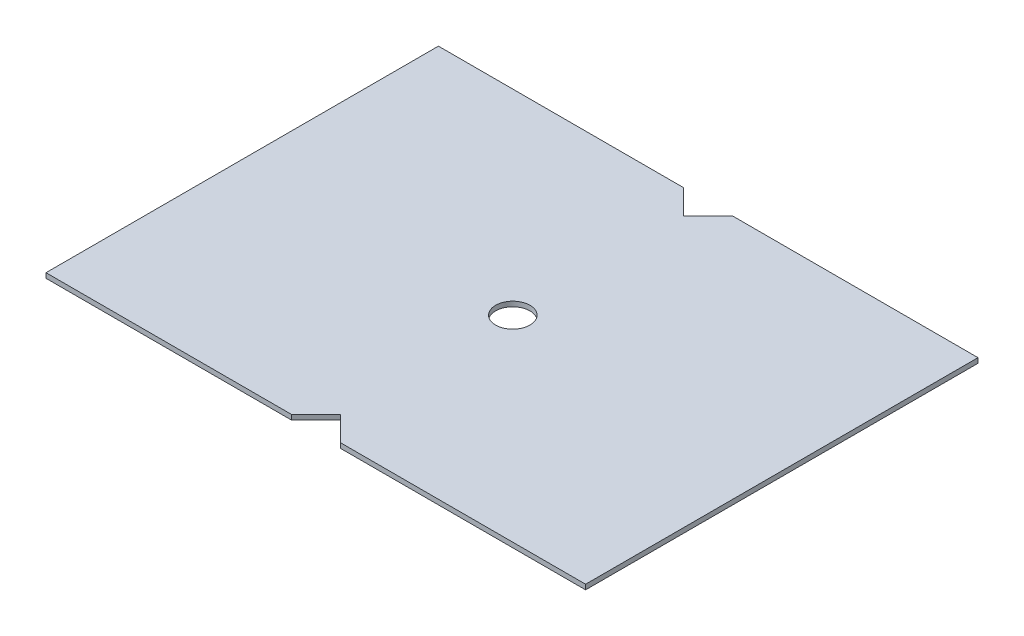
ISO-10303-21;
HEADER;
FILE_DESCRIPTION(('STEP AP214'),'2;1');
FILE_NAME('part.step','',(''),(''),'','','');
FILE_SCHEMA(('AUTOMOTIVE_DESIGN { 1 0 10303 214 1 1 1 1 }'));
ENDSEC;
DATA;
#1=APPLICATION_CONTEXT('core data for automotive mechanical design processes');
#2=APPLICATION_PROTOCOL_DEFINITION('international standard','automotive_design',2000,#1);
#3=PRODUCT_CONTEXT('',#1,'mechanical');
#4=PRODUCT('Part','Part','',(#3));
#5=PRODUCT_RELATED_PRODUCT_CATEGORY('part','',(#4));
#6=PRODUCT_DEFINITION_FORMATION('','',#4);
#7=PRODUCT_DEFINITION_CONTEXT('part definition',#1,'design');
#8=PRODUCT_DEFINITION('design','',#6,#7);
#9=PRODUCT_DEFINITION_SHAPE('','',#8);
#10=(LENGTH_UNIT() NAMED_UNIT(*) SI_UNIT(.MILLI.,.METRE.));
#11=(NAMED_UNIT(*) PLANE_ANGLE_UNIT() SI_UNIT($,.RADIAN.));
#12=(NAMED_UNIT(*) SI_UNIT($,.STERADIAN.) SOLID_ANGLE_UNIT());
#13=UNCERTAINTY_MEASURE_WITH_UNIT(LENGTH_MEASURE(1.E-05),#10,'distance_accuracy_value','');
#14=(GEOMETRIC_REPRESENTATION_CONTEXT(3) GLOBAL_UNCERTAINTY_ASSIGNED_CONTEXT((#13)) GLOBAL_UNIT_ASSIGNED_CONTEXT((#10,
#11,#12)) REPRESENTATION_CONTEXT('',''));
#15=CARTESIAN_POINT('',(0.,0.,0.));
#16=DIRECTION('',(0.,0.,1.));
#17=DIRECTION('',(1.,0.,0.));
#18=AXIS2_PLACEMENT_3D('',#15,#16,#17);
#19=CARTESIAN_POINT('',(0.,1.,0.));
#20=DIRECTION('',(0.,0.,-1.));
#21=DIRECTION('',(-1.,0.,0.));
#22=AXIS2_PLACEMENT_3D('',#19,#20,#21);
#23=PLANE('',#22);
#24=DIRECTION('',(1.,0.,0.));
#25=VECTOR('',#24,1.);
#26=CARTESIAN_POINT('',(0.,0.,0.));
#27=LINE('',#26,#25);
#28=CARTESIAN_POINT('',(0.,0.,0.));
#29=VERTEX_POINT('',#28);
#30=CARTESIAN_POINT('',(50.,0.,0.));
#31=VERTEX_POINT('',#30);
#32=EDGE_CURVE('E127',#29,#31,#27,.T.);
#33=ORIENTED_EDGE('',*,*,#32,.T.);
#34=DIRECTION('',(0.,1.,0.));
#35=VECTOR('',#34,1.);
#36=CARTESIAN_POINT('',(50.,0.,0.));
#37=LINE('',#36,#35);
#38=CARTESIAN_POINT('',(50.,1.,0.));
#39=VERTEX_POINT('',#38);
#40=EDGE_CURVE('E113',#31,#39,#37,.T.);
#41=ORIENTED_EDGE('',*,*,#40,.T.);
#42=DIRECTION('',(-1.,0.,0.));
#43=VECTOR('',#42,1.);
#44=CARTESIAN_POINT('',(0.,1.,0.));
#45=LINE('',#44,#43);
#46=CARTESIAN_POINT('',(0.,1.,0.));
#47=VERTEX_POINT('',#46);
#48=EDGE_CURVE('E125',#39,#47,#45,.T.);
#49=ORIENTED_EDGE('',*,*,#48,.T.);
#50=DIRECTION('',(0.,-1.,0.));
#51=VECTOR('',#50,1.);
#52=CARTESIAN_POINT('',(0.,0.,0.));
#53=LINE('',#52,#51);
#54=EDGE_CURVE('E163',#47,#29,#53,.T.);
#55=ORIENTED_EDGE('',*,*,#54,.T.);
#56=EDGE_LOOP('',(#33,#41,#49,#55));
#57=FACE_BOUND('',#56,.T.);
#58=ADVANCED_FACE('F31',(#57),#23,.F.);
#59=CARTESIAN_POINT('',(0.,1.,-80.));
#60=DIRECTION('',(0.,0.,-1.));
#61=DIRECTION('',(-1.,0.,0.));
#62=AXIS2_PLACEMENT_3D('',#59,#60,#61);
#63=PLANE('',#62);
#64=DIRECTION('',(0.,1.,0.));
#65=VECTOR('',#64,1.);
#66=CARTESIAN_POINT('',(49.9999999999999,0.,-80.));
#67=LINE('',#66,#65);
#68=CARTESIAN_POINT('',(49.9999999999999,0.,-80.));
#69=VERTEX_POINT('',#68);
#70=CARTESIAN_POINT('',(49.9999999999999,1.,-80.));
#71=VERTEX_POINT('',#70);
#72=EDGE_CURVE('E178',#69,#71,#67,.T.);
#73=ORIENTED_EDGE('',*,*,#72,.F.);
#74=DIRECTION('',(1.,0.,0.));
#75=VECTOR('',#74,1.);
#76=CARTESIAN_POINT('',(0.,0.,-80.));
#77=LINE('',#76,#75);
#78=CARTESIAN_POINT('',(0.,0.,-80.));
#79=VERTEX_POINT('',#78);
#80=EDGE_CURVE('E146',#79,#69,#77,.T.);
#81=ORIENTED_EDGE('',*,*,#80,.F.);
#82=DIRECTION('',(0.,-1.,0.));
#83=VECTOR('',#82,1.);
#84=CARTESIAN_POINT('',(0.,0.,-80.));
#85=LINE('',#84,#83);
#86=CARTESIAN_POINT('',(0.,1.,-80.));
#87=VERTEX_POINT('',#86);
#88=EDGE_CURVE('E138',#87,#79,#85,.T.);
#89=ORIENTED_EDGE('',*,*,#88,.F.);
#90=DIRECTION('',(-1.,0.,0.));
#91=VECTOR('',#90,1.);
#92=CARTESIAN_POINT('',(0.,1.,-80.));
#93=LINE('',#92,#91);
#94=EDGE_CURVE('E152',#71,#87,#93,.T.);
#95=ORIENTED_EDGE('',*,*,#94,.F.);
#96=EDGE_LOOP('',(#73,#81,#89,#95));
#97=FACE_BOUND('',#96,.T.);
#98=ADVANCED_FACE('F217',(#97),#63,.T.);
#99=CARTESIAN_POINT('',(0.,0.,-80.));
#100=DIRECTION('',(-1.,0.,0.));
#101=DIRECTION('',(0.,0.,1.));
#102=AXIS2_PLACEMENT_3D('',#99,#100,#101);
#103=PLANE('',#102);
#104=ORIENTED_EDGE('',*,*,#54,.F.);
#105=DIRECTION('',(0.,0.,1.));
#106=VECTOR('',#105,1.);
#107=CARTESIAN_POINT('',(0.,1.,-80.));
#108=LINE('',#107,#106);
#109=EDGE_CURVE('E11',#87,#47,#108,.T.);
#110=ORIENTED_EDGE('',*,*,#109,.F.);
#111=ORIENTED_EDGE('',*,*,#88,.T.);
#112=DIRECTION('',(0.,0.,1.));
#113=VECTOR('',#112,1.);
#114=CARTESIAN_POINT('',(0.,0.,-80.));
#115=LINE('',#114,#113);
#116=EDGE_CURVE('E35',#79,#29,#115,.T.);
#117=ORIENTED_EDGE('',*,*,#116,.T.);
#118=EDGE_LOOP('',(#104,#110,#111,#117));
#119=FACE_BOUND('',#118,.T.);
#120=ADVANCED_FACE('F33',(#119),#103,.T.);
#121=CARTESIAN_POINT('',(0.,1.,-80.));
#122=DIRECTION('',(0.,1.,0.));
#123=DIRECTION('',(0.,0.,1.));
#124=AXIS2_PLACEMENT_3D('',#121,#122,#123);
#125=PLANE('',#124);
#126=DIRECTION('',(-0.707106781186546,0.,0.707106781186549));
#127=VECTOR('',#126,1.);
#128=CARTESIAN_POINT('',(55.,1.,-5.));
#129=LINE('',#128,#127);
#130=CARTESIAN_POINT('',(55.,1.,-5.));
#131=VERTEX_POINT('',#130);
#132=EDGE_CURVE('E109',#131,#39,#129,.T.);
#133=ORIENTED_EDGE('',*,*,#132,.F.);
#134=DIRECTION('',(-0.707106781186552,0.,-0.707106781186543));
#135=VECTOR('',#134,1.);
#136=CARTESIAN_POINT('',(55.,1.,-5.));
#137=LINE('',#136,#135);
#138=CARTESIAN_POINT('',(60.0000000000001,1.,0.));
#139=VERTEX_POINT('',#138);
#140=EDGE_CURVE('E120',#139,#131,#137,.T.);
#141=ORIENTED_EDGE('',*,*,#140,.F.);
#142=CARTESIAN_POINT('',(110.,1.,0.));
#143=VERTEX_POINT('',#142);
#144=EDGE_CURVE('E134',#143,#139,#45,.T.);
#145=ORIENTED_EDGE('',*,*,#144,.F.);
#146=DIRECTION('',(0.,0.,1.));
#147=VECTOR('',#146,1.);
#148=CARTESIAN_POINT('',(110.,1.,-80.));
#149=LINE('',#148,#147);
#150=CARTESIAN_POINT('',(110.,1.,-80.));
#151=VERTEX_POINT('',#150);
#152=EDGE_CURVE('E40',#151,#143,#149,.T.);
#153=ORIENTED_EDGE('',*,*,#152,.F.);
#154=CARTESIAN_POINT('',(59.9999999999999,1.,-80.));
#155=VERTEX_POINT('',#154);
#156=EDGE_CURVE('E153',#151,#155,#93,.T.);
#157=ORIENTED_EDGE('',*,*,#156,.T.);
#158=DIRECTION('',(0.707106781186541,0.,-0.707106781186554));
#159=VECTOR('',#158,1.);
#160=CARTESIAN_POINT('',(55.,1.,-75.));
#161=LINE('',#160,#159);
#162=CARTESIAN_POINT('',(55.,1.,-75.));
#163=VERTEX_POINT('',#162);
#164=EDGE_CURVE('E56',#163,#155,#161,.T.);
#165=ORIENTED_EDGE('',*,*,#164,.F.);
#166=DIRECTION('',(0.707106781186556,0.,0.707106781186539));
#167=VECTOR('',#166,1.);
#168=CARTESIAN_POINT('',(55.,1.,-75.));
#169=LINE('',#168,#167);
#170=EDGE_CURVE('E191',#71,#163,#169,.T.);
#171=ORIENTED_EDGE('',*,*,#170,.F.);
#172=ORIENTED_EDGE('',*,*,#94,.T.);
#173=ORIENTED_EDGE('',*,*,#109,.T.);
#174=ORIENTED_EDGE('',*,*,#48,.F.);
#175=EDGE_LOOP('',(#133,#141,#145,#153,#157,#165,#171,#172,#173,#174));
#176=FACE_BOUND('',#175,.T.);
#177=CARTESIAN_POINT('',(55.0827009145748,1.,-40.0827009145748));
#178=DIRECTION('',(0.,1.,0.));
#179=DIRECTION('',(0.,0.,1.));
#180=AXIS2_PLACEMENT_3D('',#177,#178,#179);
#181=CIRCLE('',#180,3.5);
#182=CARTESIAN_POINT('',(55.0827009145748,1.,-36.5827009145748));
#183=VERTEX_POINT('',#182);
#184=EDGE_CURVE('E173',#183,#183,#181,.T.);
#185=ORIENTED_EDGE('',*,*,#184,.F.);
#186=EDGE_LOOP('',(#185));
#187=FACE_BOUND('',#186,.T.);
#188=ADVANCED_FACE('F130',(#176,#187),#125,.T.);
#189=CARTESIAN_POINT('',(110.,0.,-80.));
#190=DIRECTION('',(1.,0.,0.));
#191=DIRECTION('',(0.,0.,-1.));
#192=AXIS2_PLACEMENT_3D('',#189,#190,#191);
#193=PLANE('',#192);
#194=DIRECTION('',(0.,1.,0.));
#195=VECTOR('',#194,1.);
#196=CARTESIAN_POINT('',(110.,0.,0.));
#197=LINE('',#196,#195);
#198=CARTESIAN_POINT('',(110.,0.,0.));
#199=VERTEX_POINT('',#198);
#200=EDGE_CURVE('E135',#199,#143,#197,.T.);
#201=ORIENTED_EDGE('',*,*,#200,.F.);
#202=DIRECTION('',(0.,0.,1.));
#203=VECTOR('',#202,1.);
#204=CARTESIAN_POINT('',(110.,0.,-80.));
#205=LINE('',#204,#203);
#206=CARTESIAN_POINT('',(110.,0.,-80.));
#207=VERTEX_POINT('',#206);
#208=EDGE_CURVE('E156',#207,#199,#205,.T.);
#209=ORIENTED_EDGE('',*,*,#208,.F.);
#210=DIRECTION('',(0.,1.,0.));
#211=VECTOR('',#210,1.);
#212=CARTESIAN_POINT('',(110.,0.,-80.));
#213=LINE('',#212,#211);
#214=EDGE_CURVE('E149',#207,#151,#213,.T.);
#215=ORIENTED_EDGE('',*,*,#214,.T.);
#216=ORIENTED_EDGE('',*,*,#152,.T.);
#217=EDGE_LOOP('',(#201,#209,#215,#216));
#218=FACE_BOUND('',#217,.T.);
#219=ADVANCED_FACE('F203',(#218),#193,.T.);
#220=CARTESIAN_POINT('',(0.,0.,-80.));
#221=DIRECTION('',(0.,-1.,0.));
#222=DIRECTION('',(0.,0.,-1.));
#223=AXIS2_PLACEMENT_3D('',#220,#221,#222);
#224=PLANE('',#223);
#225=DIRECTION('',(-0.707106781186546,0.,0.707106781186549));
#226=VECTOR('',#225,1.);
#227=CARTESIAN_POINT('',(55.,0.,-5.));
#228=LINE('',#227,#226);
#229=CARTESIAN_POINT('',(55.,0.,-5.));
#230=VERTEX_POINT('',#229);
#231=EDGE_CURVE('E168',#230,#31,#228,.T.);
#232=ORIENTED_EDGE('',*,*,#231,.T.);
#233=ORIENTED_EDGE('',*,*,#32,.F.);
#234=ORIENTED_EDGE('',*,*,#116,.F.);
#235=ORIENTED_EDGE('',*,*,#80,.T.);
#236=DIRECTION('',(0.707106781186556,0.,0.707106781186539));
#237=VECTOR('',#236,1.);
#238=CARTESIAN_POINT('',(55.,0.,-75.));
#239=LINE('',#238,#237);
#240=CARTESIAN_POINT('',(55.,0.,-75.));
#241=VERTEX_POINT('',#240);
#242=EDGE_CURVE('E187',#69,#241,#239,.T.);
#243=ORIENTED_EDGE('',*,*,#242,.T.);
#244=DIRECTION('',(0.707106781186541,0.,-0.707106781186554));
#245=VECTOR('',#244,1.);
#246=CARTESIAN_POINT('',(55.,0.,-75.));
#247=LINE('',#246,#245);
#248=CARTESIAN_POINT('',(59.9999999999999,0.,-80.));
#249=VERTEX_POINT('',#248);
#250=EDGE_CURVE('E182',#241,#249,#247,.T.);
#251=ORIENTED_EDGE('',*,*,#250,.T.);
#252=EDGE_CURVE('E145',#249,#207,#77,.T.);
#253=ORIENTED_EDGE('',*,*,#252,.T.);
#254=ORIENTED_EDGE('',*,*,#208,.T.);
#255=CARTESIAN_POINT('',(60.0000000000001,0.,0.));
#256=VERTEX_POINT('',#255);
#257=EDGE_CURVE('E169',#256,#199,#27,.T.);
#258=ORIENTED_EDGE('',*,*,#257,.F.);
#259=DIRECTION('',(-0.707106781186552,0.,-0.707106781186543));
#260=VECTOR('',#259,1.);
#261=CARTESIAN_POINT('',(55.,0.,-5.));
#262=LINE('',#261,#260);
#263=EDGE_CURVE('E48',#256,#230,#262,.T.);
#264=ORIENTED_EDGE('',*,*,#263,.T.);
#265=EDGE_LOOP('',(#232,#233,#234,#235,#243,#251,#253,#254,#258,#264));
#266=FACE_BOUND('',#265,.T.);
#267=CARTESIAN_POINT('',(55.0827009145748,0.,-40.0827009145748));
#268=DIRECTION('',(0.,1.,0.));
#269=DIRECTION('',(0.,0.,1.));
#270=AXIS2_PLACEMENT_3D('',#267,#268,#269);
#271=CIRCLE('',#270,3.5);
#272=CARTESIAN_POINT('',(55.0827009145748,0.,-36.5827009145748));
#273=VERTEX_POINT('',#272);
#274=EDGE_CURVE('E170',#273,#273,#271,.T.);
#275=ORIENTED_EDGE('',*,*,#274,.T.);
#276=EDGE_LOOP('',(#275));
#277=FACE_BOUND('',#276,.T.);
#278=ADVANCED_FACE('F166',(#266,#277),#224,.T.);
#279=DIRECTION('',(0.,1.,0.));
#280=VECTOR('',#279,1.);
#281=CARTESIAN_POINT('',(59.9999999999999,0.,-80.));
#282=LINE('',#281,#280);
#283=EDGE_CURVE('E181',#249,#155,#282,.T.);
#284=ORIENTED_EDGE('',*,*,#283,.T.);
#285=ORIENTED_EDGE('',*,*,#156,.F.);
#286=ORIENTED_EDGE('',*,*,#214,.F.);
#287=ORIENTED_EDGE('',*,*,#252,.F.);
#288=EDGE_LOOP('',(#284,#285,#286,#287));
#289=FACE_BOUND('',#288,.T.);
#290=ADVANCED_FACE('F208',(#289),#63,.T.);
#291=ORIENTED_EDGE('',*,*,#144,.T.);
#292=DIRECTION('',(0.,1.,0.));
#293=VECTOR('',#292,1.);
#294=CARTESIAN_POINT('',(60.0000000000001,0.,0.));
#295=LINE('',#294,#293);
#296=EDGE_CURVE('E128',#256,#139,#295,.T.);
#297=ORIENTED_EDGE('',*,*,#296,.F.);
#298=ORIENTED_EDGE('',*,*,#257,.T.);
#299=ORIENTED_EDGE('',*,*,#200,.T.);
#300=EDGE_LOOP('',(#291,#297,#298,#299));
#301=FACE_BOUND('',#300,.T.);
#302=ADVANCED_FACE('F201',(#301),#23,.F.);
#303=CARTESIAN_POINT('',(55.0827009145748,0.,-40.0827009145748));
#304=DIRECTION('',(0.,1.,0.));
#305=DIRECTION('',(0.,0.,1.));
#306=AXIS2_PLACEMENT_3D('',#303,#304,#305);
#307=CYLINDRICAL_SURFACE('',#306,3.5);
#308=ORIENTED_EDGE('',*,*,#274,.F.);
#309=EDGE_LOOP('',(#308));
#310=FACE_BOUND('',#309,.T.);
#311=ORIENTED_EDGE('',*,*,#184,.T.);
#312=EDGE_LOOP('',(#311));
#313=FACE_BOUND('',#312,.T.);
#314=ADVANCED_FACE('F232',(#310,#313),#307,.F.);
#315=CARTESIAN_POINT('',(55.,0.,-75.));
#316=DIRECTION('',(-0.707106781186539,0.,0.707106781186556));
#317=DIRECTION('',(0.707106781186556,0.,0.707106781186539));
#318=AXIS2_PLACEMENT_3D('',#315,#316,#317);
#319=PLANE('',#318);
#320=ORIENTED_EDGE('',*,*,#170,.T.);
#321=DIRECTION('',(0.,1.,0.));
#322=VECTOR('',#321,1.);
#323=CARTESIAN_POINT('',(55.,0.,-75.));
#324=LINE('',#323,#322);
#325=EDGE_CURVE('E179',#241,#163,#324,.T.);
#326=ORIENTED_EDGE('',*,*,#325,.F.);
#327=ORIENTED_EDGE('',*,*,#242,.F.);
#328=ORIENTED_EDGE('',*,*,#72,.T.);
#329=EDGE_LOOP('',(#320,#326,#327,#328));
#330=FACE_BOUND('',#329,.T.);
#331=ADVANCED_FACE('F214',(#330),#319,.F.);
#332=CARTESIAN_POINT('',(55.,0.,-75.));
#333=DIRECTION('',(0.707106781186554,0.,0.707106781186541));
#334=DIRECTION('',(0.707106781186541,0.,-0.707106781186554));
#335=AXIS2_PLACEMENT_3D('',#332,#333,#334);
#336=PLANE('',#335);
#337=ORIENTED_EDGE('',*,*,#164,.T.);
#338=ORIENTED_EDGE('',*,*,#283,.F.);
#339=ORIENTED_EDGE('',*,*,#250,.F.);
#340=ORIENTED_EDGE('',*,*,#325,.T.);
#341=EDGE_LOOP('',(#337,#338,#339,#340));
#342=FACE_BOUND('',#341,.T.);
#343=ADVANCED_FACE('F211',(#342),#336,.F.);
#344=CARTESIAN_POINT('',(55.,0.,-5.));
#345=DIRECTION('',(-0.707106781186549,0.,-0.707106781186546));
#346=DIRECTION('',(-0.707106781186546,0.,0.707106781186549));
#347=AXIS2_PLACEMENT_3D('',#344,#345,#346);
#348=PLANE('',#347);
#349=ORIENTED_EDGE('',*,*,#132,.T.);
#350=ORIENTED_EDGE('',*,*,#40,.F.);
#351=ORIENTED_EDGE('',*,*,#231,.F.);
#352=DIRECTION('',(0.,1.,0.));
#353=VECTOR('',#352,1.);
#354=CARTESIAN_POINT('',(55.,0.,-5.));
#355=LINE('',#354,#353);
#356=EDGE_CURVE('E115',#230,#131,#355,.T.);
#357=ORIENTED_EDGE('',*,*,#356,.T.);
#358=EDGE_LOOP('',(#349,#350,#351,#357));
#359=FACE_BOUND('',#358,.T.);
#360=ADVANCED_FACE('F111',(#359),#348,.F.);
#361=CARTESIAN_POINT('',(55.,0.,-5.));
#362=DIRECTION('',(0.707106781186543,0.,-0.707106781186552));
#363=DIRECTION('',(-0.707106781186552,0.,-0.707106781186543));
#364=AXIS2_PLACEMENT_3D('',#361,#362,#363);
#365=PLANE('',#364);
#366=ORIENTED_EDGE('',*,*,#140,.T.);
#367=ORIENTED_EDGE('',*,*,#356,.F.);
#368=ORIENTED_EDGE('',*,*,#263,.F.);
#369=ORIENTED_EDGE('',*,*,#296,.T.);
#370=EDGE_LOOP('',(#366,#367,#368,#369));
#371=FACE_BOUND('',#370,.T.);
#372=ADVANCED_FACE('F198',(#371),#365,.F.);
#373=CLOSED_SHELL('',(#58,#98,#120,#188,#219,#278,#290,#302,#314,#331,#343,#360,#372));
#374=MANIFOLD_SOLID_BREP('B2',#373);
#375=ADVANCED_BREP_SHAPE_REPRESENTATION('',(#18,#374),#14);
#376=SHAPE_DEFINITION_REPRESENTATION(#9,#375);
ENDSEC;
END-ISO-10303-21;
